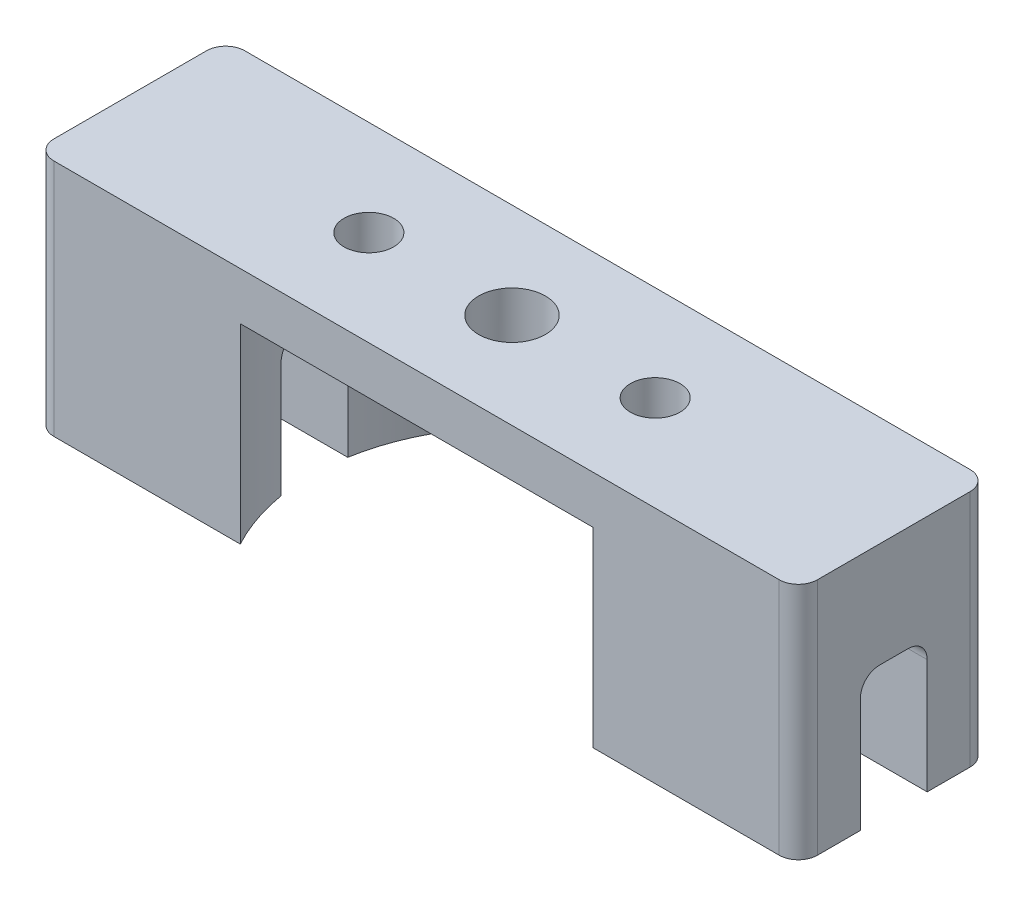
from build123d import *

# Parameters (mm, degrees)
SKETCH1_W           = 101.6
SKETCH1_H           = 25.4
BOSS_EXTRUDE1_DEPTH = 31.75
SKETCH2_W           = 4.445
SKETCH2_H           = 17.78
CUT_EXTRUDE1_DEPTH  = 110.433918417
FILLET1_R           = 2.54
SKETCH3_R           = 26.67
CUT_EXTRUDE2_DEPTH  = 25.4
SKETCH4_R           = 4.445
SKETCH4_R_2         = 3.302
CUT_EXTRUDE3_DEPTH  = 110.433918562
FILLET2_R           = 2.54


with BuildPart() as part:
    # Sketch1 → Boss-Extrude1 (new body)
    with BuildSketch(Plane(origin=(0, 0, 0), x_dir=(1, 0, 0), z_dir=(0, 1, 0))):
        with Locations((50.8, 12.7)):
            Rectangle(SKETCH1_W, SKETCH1_H)
    extrude(amount=BOSS_EXTRUDE1_DEPTH)

    # Sketch2 → Cut-Extrude1 (cut, through all)
    with BuildSketch(Plane(origin=(101.6, 0, 0), x_dir=(0, 0, -1), z_dir=(1, 0, 0))):
        with Locations((14.9225, 8.89)):
            Rectangle(SKETCH2_W, SKETCH2_H)
        with Locations((10.4775, 8.89)):
            Rectangle(SKETCH2_W, SKETCH2_H)
    extrude(amount=-CUT_EXTRUDE1_DEPTH, mode=Mode.SUBTRACT)

    # Fillet1
    fillet1_edges = [part.edges().sort_by_distance(p)[0] for p in [
        (50.8, 17.78, -8.255),
        (50.8, 17.78, -17.145),
    ]]
    fillet(fillet1_edges, radius=FILLET1_R)

    # Sketch3 → Cut-Extrude2 (cut)
    with BuildSketch(Plane.XZ):
        with Locations((50.8, -12.7)):
            Circle(SKETCH3_R)
    extrude(amount=-CUT_EXTRUDE2_DEPTH, mode=Mode.SUBTRACT)

    # Sketch4 → Cut-Extrude3 (cut, through all)
    with BuildSketch(Plane(origin=(0, 31.75, 0), x_dir=(1, 0, 0), z_dir=(0, 1, 0))):
        with Locations(Location((50.8, 12.7, 0), (0, 0, 270))):
            Circle(SKETCH4_R)
        with Locations(Location((31.75, 12.7, 0), (0, 0, 270))):
            Circle(SKETCH4_R_2)
        with Locations(Location((69.85, 12.7, 0), (0, 0, 90))):
            Circle(SKETCH4_R_2)
    extrude(amount=-CUT_EXTRUDE3_DEPTH, mode=Mode.SUBTRACT)

    # Fillet2
    fillet2_edges = [part.edges().sort_by_distance(p)[0] for p in [
        (0, 15.875, -25.4),
        (101.6, 15.875, -25.4),
        (101.6, 15.875, 0),
        (0, 15.875, 0),
    ]]
    fillet(fillet2_edges, radius=FILLET2_R)


solid = part.part
